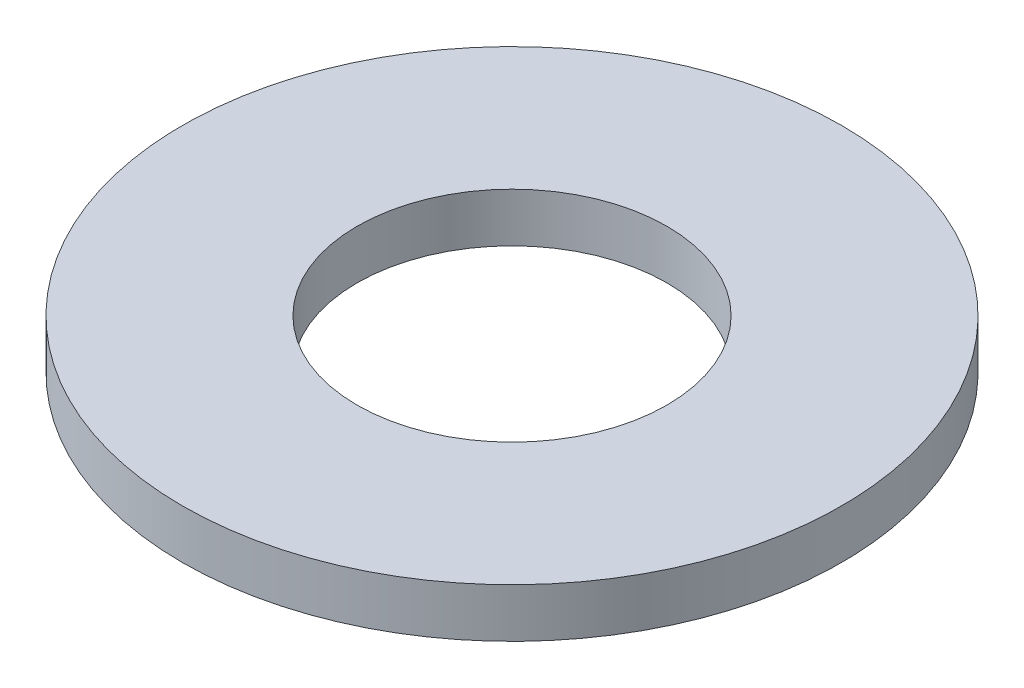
ISO-10303-21;
HEADER;
FILE_DESCRIPTION(('STEP AP214'),'2;1');
FILE_NAME('part.step','',(''),(''),'','','');
FILE_SCHEMA(('AUTOMOTIVE_DESIGN { 1 0 10303 214 1 1 1 1 }'));
ENDSEC;
DATA;
#1=APPLICATION_CONTEXT('core data for automotive mechanical design processes');
#2=APPLICATION_PROTOCOL_DEFINITION('international standard','automotive_design',2000,#1);
#3=PRODUCT_CONTEXT('',#1,'mechanical');
#4=PRODUCT('Part','Part','',(#3));
#5=PRODUCT_RELATED_PRODUCT_CATEGORY('part','',(#4));
#6=PRODUCT_DEFINITION_FORMATION('','',#4);
#7=PRODUCT_DEFINITION_CONTEXT('part definition',#1,'design');
#8=PRODUCT_DEFINITION('design','',#6,#7);
#9=PRODUCT_DEFINITION_SHAPE('','',#8);
#10=(LENGTH_UNIT() NAMED_UNIT(*) SI_UNIT(.MILLI.,.METRE.));
#11=(NAMED_UNIT(*) PLANE_ANGLE_UNIT() SI_UNIT($,.RADIAN.));
#12=(NAMED_UNIT(*) SI_UNIT($,.STERADIAN.) SOLID_ANGLE_UNIT());
#13=UNCERTAINTY_MEASURE_WITH_UNIT(LENGTH_MEASURE(1.E-05),#10,'distance_accuracy_value','');
#14=(GEOMETRIC_REPRESENTATION_CONTEXT(3) GLOBAL_UNCERTAINTY_ASSIGNED_CONTEXT((#13)) GLOBAL_UNIT_ASSIGNED_CONTEXT((#10,
#11,#12)) REPRESENTATION_CONTEXT('',''));
#15=CARTESIAN_POINT('',(0.,0.,0.));
#16=DIRECTION('',(0.,0.,1.));
#17=DIRECTION('',(1.,0.,0.));
#18=AXIS2_PLACEMENT_3D('',#15,#16,#17);
#19=CARTESIAN_POINT('',(0.,0.586,0.));
#20=DIRECTION('',(0.,1.,0.));
#21=DIRECTION('',(0.,0.,1.));
#22=AXIS2_PLACEMENT_3D('',#19,#20,#21);
#23=PLANE('',#22);
#24=CARTESIAN_POINT('',(0.,0.586,0.));
#25=DIRECTION('',(0.,1.,0.));
#26=DIRECTION('',(0.,0.,1.));
#27=AXIS2_PLACEMENT_3D('',#24,#25,#26);
#28=CIRCLE('',#27,3.935);
#29=CARTESIAN_POINT('',(0.,0.586,3.935));
#30=VERTEX_POINT('',#29);
#31=EDGE_CURVE('E10',#30,#30,#28,.T.);
#32=ORIENTED_EDGE('',*,*,#31,.T.);
#33=EDGE_LOOP('',(#32));
#34=FACE_BOUND('',#33,.T.);
#35=CARTESIAN_POINT('',(0.,0.586,0.));
#36=DIRECTION('',(0.,1.,0.));
#37=DIRECTION('',(0.,0.,1.));
#38=AXIS2_PLACEMENT_3D('',#35,#36,#37);
#39=CIRCLE('',#38,1.85);
#40=CARTESIAN_POINT('',(0.,0.586,1.85));
#41=VERTEX_POINT('',#40);
#42=EDGE_CURVE('E43',#41,#41,#39,.T.);
#43=ORIENTED_EDGE('',*,*,#42,.F.);
#44=EDGE_LOOP('',(#43));
#45=FACE_BOUND('',#44,.T.);
#46=ADVANCED_FACE('F32',(#34,#45),#23,.T.);
#47=CARTESIAN_POINT('',(0.,0.,0.));
#48=DIRECTION('',(0.,1.,0.));
#49=DIRECTION('',(0.,0.,1.));
#50=AXIS2_PLACEMENT_3D('',#47,#48,#49);
#51=PLANE('',#50);
#52=CARTESIAN_POINT('',(0.,0.,0.));
#53=DIRECTION('',(0.,1.,0.));
#54=DIRECTION('',(0.,0.,1.));
#55=AXIS2_PLACEMENT_3D('',#52,#53,#54);
#56=CIRCLE('',#55,3.935);
#57=CARTESIAN_POINT('',(0.,0.,3.935));
#58=VERTEX_POINT('',#57);
#59=EDGE_CURVE('E36',#58,#58,#56,.T.);
#60=ORIENTED_EDGE('',*,*,#59,.F.);
#61=EDGE_LOOP('',(#60));
#62=FACE_BOUND('',#61,.T.);
#63=CARTESIAN_POINT('',(0.,0.,0.));
#64=DIRECTION('',(0.,1.,0.));
#65=DIRECTION('',(0.,0.,1.));
#66=AXIS2_PLACEMENT_3D('',#63,#64,#65);
#67=CIRCLE('',#66,1.85);
#68=CARTESIAN_POINT('',(0.,0.,1.85));
#69=VERTEX_POINT('',#68);
#70=EDGE_CURVE('E45',#69,#69,#67,.T.);
#71=ORIENTED_EDGE('',*,*,#70,.T.);
#72=EDGE_LOOP('',(#71));
#73=FACE_BOUND('',#72,.T.);
#74=ADVANCED_FACE('F55',(#62,#73),#51,.F.);
#75=CARTESIAN_POINT('',(0.,0.586,0.));
#76=DIRECTION('',(0.,-1.,0.));
#77=DIRECTION('',(0.,0.,-1.));
#78=AXIS2_PLACEMENT_3D('',#75,#76,#77);
#79=CYLINDRICAL_SURFACE('',#78,3.935);
#80=ORIENTED_EDGE('',*,*,#31,.F.);
#81=EDGE_LOOP('',(#80));
#82=FACE_BOUND('',#81,.T.);
#83=ORIENTED_EDGE('',*,*,#59,.T.);
#84=EDGE_LOOP('',(#83));
#85=FACE_BOUND('',#84,.T.);
#86=ADVANCED_FACE('F34',(#82,#85),#79,.T.);
#87=CARTESIAN_POINT('',(0.,0.586,0.));
#88=DIRECTION('',(0.,-1.,0.));
#89=DIRECTION('',(0.,0.,-1.));
#90=AXIS2_PLACEMENT_3D('',#87,#88,#89);
#91=CYLINDRICAL_SURFACE('',#90,1.85);
#92=ORIENTED_EDGE('',*,*,#42,.T.);
#93=EDGE_LOOP('',(#92));
#94=FACE_BOUND('',#93,.T.);
#95=ORIENTED_EDGE('',*,*,#70,.F.);
#96=EDGE_LOOP('',(#95));
#97=FACE_BOUND('',#96,.T.);
#98=ADVANCED_FACE('F51',(#94,#97),#91,.F.);
#99=CLOSED_SHELL('',(#46,#74,#86,#98));
#100=MANIFOLD_SOLID_BREP('B2',#99);
#101=ADVANCED_BREP_SHAPE_REPRESENTATION('',(#18,#100),#14);
#102=SHAPE_DEFINITION_REPRESENTATION(#9,#101);
ENDSEC;
END-ISO-10303-21;
